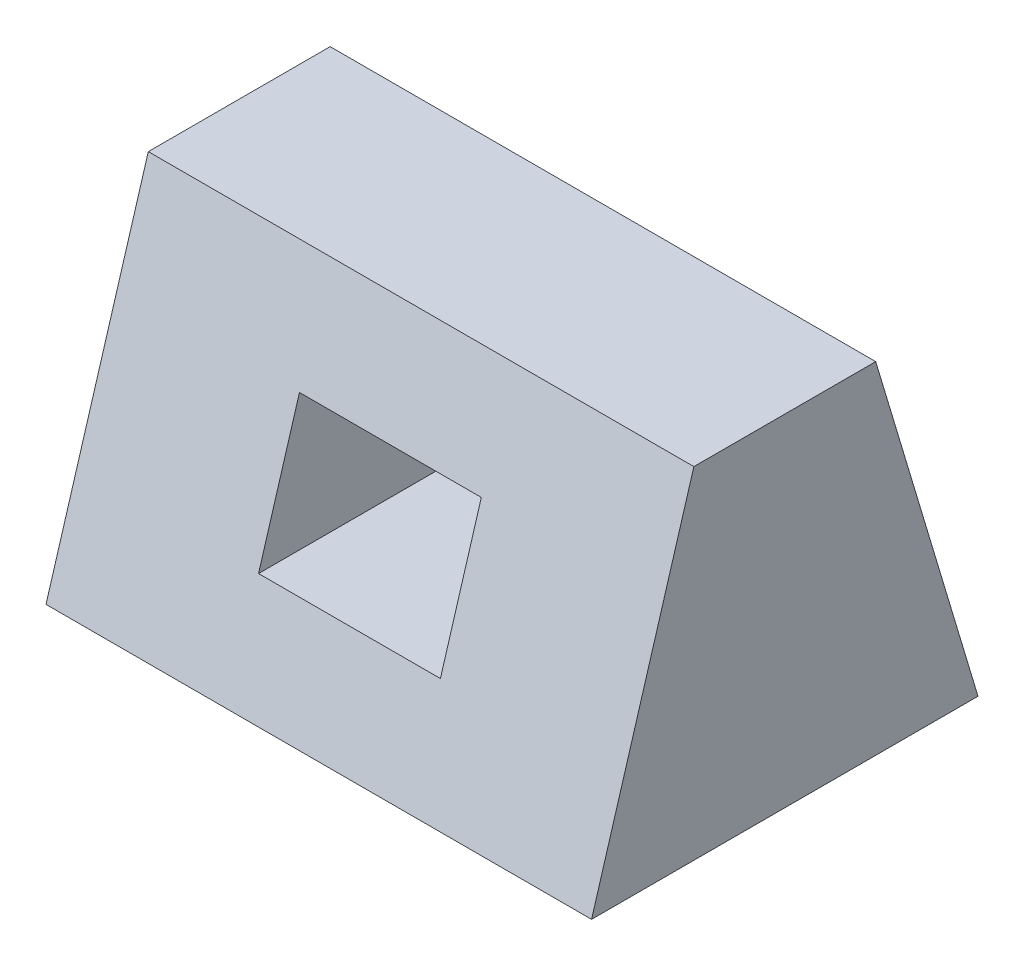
ISO-10303-21;
HEADER;
FILE_DESCRIPTION(('STEP AP214'),'2;1');
FILE_NAME('part.step','',(''),(''),'','','');
FILE_SCHEMA(('AUTOMOTIVE_DESIGN { 1 0 10303 214 1 1 1 1 }'));
ENDSEC;
DATA;
#1=APPLICATION_CONTEXT('core data for automotive mechanical design processes');
#2=APPLICATION_PROTOCOL_DEFINITION('international standard','automotive_design',2000,#1);
#3=PRODUCT_CONTEXT('',#1,'mechanical');
#4=PRODUCT('Part','Part','',(#3));
#5=PRODUCT_RELATED_PRODUCT_CATEGORY('part','',(#4));
#6=PRODUCT_DEFINITION_FORMATION('','',#4);
#7=PRODUCT_DEFINITION_CONTEXT('part definition',#1,'design');
#8=PRODUCT_DEFINITION('design','',#6,#7);
#9=PRODUCT_DEFINITION_SHAPE('','',#8);
#10=(LENGTH_UNIT() NAMED_UNIT(*) SI_UNIT(.MILLI.,.METRE.));
#11=(NAMED_UNIT(*) PLANE_ANGLE_UNIT() SI_UNIT($,.RADIAN.));
#12=(NAMED_UNIT(*) SI_UNIT($,.STERADIAN.) SOLID_ANGLE_UNIT());
#13=UNCERTAINTY_MEASURE_WITH_UNIT(LENGTH_MEASURE(1.E-05),#10,'distance_accuracy_value','');
#14=(GEOMETRIC_REPRESENTATION_CONTEXT(3) GLOBAL_UNCERTAINTY_ASSIGNED_CONTEXT((#13)) GLOBAL_UNIT_ASSIGNED_CONTEXT((#10,
#11,#12)) REPRESENTATION_CONTEXT('',''));
#15=CARTESIAN_POINT('',(0.,0.,0.));
#16=DIRECTION('',(0.,0.,1.));
#17=DIRECTION('',(1.,0.,0.));
#18=AXIS2_PLACEMENT_3D('',#15,#16,#17);
#19=CARTESIAN_POINT('',(120.,75.,20.));
#20=DIRECTION('',(0.,-0.287347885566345,-0.957826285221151));
#21=DIRECTION('',(0.,0.957826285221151,-0.287347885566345));
#22=AXIS2_PLACEMENT_3D('',#19,#20,#21);
#23=PLANE('',#22);
#24=DIRECTION('',(-1.,0.,0.));
#25=VECTOR('',#24,1.);
#26=CARTESIAN_POINT('',(120.,22.5,35.75));
#27=LINE('',#26,#25);
#28=CARTESIAN_POINT('',(80.,22.5,35.75));
#29=VERTEX_POINT('',#28);
#30=CARTESIAN_POINT('',(40.,22.5,35.75));
#31=VERTEX_POINT('',#30);
#32=EDGE_CURVE('E151',#29,#31,#27,.T.);
#33=ORIENTED_EDGE('',*,*,#32,.T.);
#34=DIRECTION('',(0.,0.957826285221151,-0.287347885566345));
#35=VECTOR('',#34,1.);
#36=CARTESIAN_POINT('',(40.,75.,20.));
#37=LINE('',#36,#35);
#38=CARTESIAN_POINT('',(40.,52.5,26.75));
#39=VERTEX_POINT('',#38);
#40=EDGE_CURVE('E104',#31,#39,#37,.T.);
#41=ORIENTED_EDGE('',*,*,#40,.T.);
#42=DIRECTION('',(1.,0.,0.));
#43=VECTOR('',#42,1.);
#44=CARTESIAN_POINT('',(120.,52.5,26.75));
#45=LINE('',#44,#43);
#46=CARTESIAN_POINT('',(80.,52.5,26.75));
#47=VERTEX_POINT('',#46);
#48=EDGE_CURVE('E145',#39,#47,#45,.T.);
#49=ORIENTED_EDGE('',*,*,#48,.T.);
#50=DIRECTION('',(0.,-0.957826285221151,0.287347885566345));
#51=VECTOR('',#50,1.);
#52=CARTESIAN_POINT('',(80.,75.,20.));
#53=LINE('',#52,#51);
#54=EDGE_CURVE('E148',#47,#29,#53,.T.);
#55=ORIENTED_EDGE('',*,*,#54,.T.);
#56=EDGE_LOOP('',(#33,#41,#49,#55));
#57=FACE_BOUND('',#56,.T.);
#58=DIRECTION('',(0.,-0.957826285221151,0.287347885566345));
#59=VECTOR('',#58,1.);
#60=CARTESIAN_POINT('',(0.,75.,20.));
#61=LINE('',#60,#59);
#62=CARTESIAN_POINT('',(0.,75.,20.));
#63=VERTEX_POINT('',#62);
#64=CARTESIAN_POINT('',(0.,0.,42.5));
#65=VERTEX_POINT('',#64);
#66=EDGE_CURVE('E134',#63,#65,#61,.T.);
#67=ORIENTED_EDGE('',*,*,#66,.T.);
#68=DIRECTION('',(-1.,0.,0.));
#69=VECTOR('',#68,1.);
#70=CARTESIAN_POINT('',(120.,0.,42.5));
#71=LINE('',#70,#69);
#72=CARTESIAN_POINT('',(120.,0.,42.5));
#73=VERTEX_POINT('',#72);
#74=EDGE_CURVE('E97',#73,#65,#71,.T.);
#75=ORIENTED_EDGE('',*,*,#74,.F.);
#76=DIRECTION('',(0.,-0.957826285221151,0.287347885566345));
#77=VECTOR('',#76,1.);
#78=CARTESIAN_POINT('',(120.,75.,20.));
#79=LINE('',#78,#77);
#80=CARTESIAN_POINT('',(120.,75.,20.));
#81=VERTEX_POINT('',#80);
#82=EDGE_CURVE('E129',#81,#73,#79,.T.);
#83=ORIENTED_EDGE('',*,*,#82,.F.);
#84=DIRECTION('',(-1.,0.,0.));
#85=VECTOR('',#84,1.);
#86=CARTESIAN_POINT('',(120.,75.,20.));
#87=LINE('',#86,#85);
#88=EDGE_CURVE('E123',#81,#63,#87,.T.);
#89=ORIENTED_EDGE('',*,*,#88,.T.);
#90=EDGE_LOOP('',(#67,#75,#83,#89));
#91=FACE_BOUND('',#90,.T.);
#92=ADVANCED_FACE('F31',(#57,#91),#23,.F.);
#93=CARTESIAN_POINT('',(120.,0.,42.5));
#94=DIRECTION('',(0.,1.,0.));
#95=DIRECTION('',(0.,0.,1.));
#96=AXIS2_PLACEMENT_3D('',#93,#94,#95);
#97=PLANE('',#96);
#98=DIRECTION('',(0.,0.,-1.));
#99=VECTOR('',#98,1.);
#100=CARTESIAN_POINT('',(0.,0.,42.5));
#101=LINE('',#100,#99);
#102=CARTESIAN_POINT('',(0.,0.,-42.5));
#103=VERTEX_POINT('',#102);
#104=EDGE_CURVE('E132',#65,#103,#101,.T.);
#105=ORIENTED_EDGE('',*,*,#104,.T.);
#106=DIRECTION('',(-1.,0.,0.));
#107=VECTOR('',#106,1.);
#108=CARTESIAN_POINT('',(120.,0.,-42.5));
#109=LINE('',#108,#107);
#110=CARTESIAN_POINT('',(120.,0.,-42.5));
#111=VERTEX_POINT('',#110);
#112=EDGE_CURVE('E117',#111,#103,#109,.T.);
#113=ORIENTED_EDGE('',*,*,#112,.F.);
#114=DIRECTION('',(0.,0.,-1.));
#115=VECTOR('',#114,1.);
#116=CARTESIAN_POINT('',(120.,0.,42.5));
#117=LINE('',#116,#115);
#118=EDGE_CURVE('E140',#73,#111,#117,.T.);
#119=ORIENTED_EDGE('',*,*,#118,.F.);
#120=ORIENTED_EDGE('',*,*,#74,.T.);
#121=EDGE_LOOP('',(#105,#113,#119,#120));
#122=FACE_BOUND('',#121,.T.);
#123=ADVANCED_FACE('F172',(#122),#97,.F.);
#124=CARTESIAN_POINT('',(120.,0.,-42.5));
#125=DIRECTION('',(0.,-0.287347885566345,0.957826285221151));
#126=DIRECTION('',(0.,-0.957826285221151,-0.287347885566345));
#127=AXIS2_PLACEMENT_3D('',#124,#125,#126);
#128=PLANE('',#127);
#129=DIRECTION('',(-1.,0.,0.));
#130=VECTOR('',#129,1.);
#131=CARTESIAN_POINT('',(120.,52.5,-26.75));
#132=LINE('',#131,#130);
#133=CARTESIAN_POINT('',(80.,52.5,-26.75));
#134=VERTEX_POINT('',#133);
#135=CARTESIAN_POINT('',(40.,52.5,-26.75));
#136=VERTEX_POINT('',#135);
#137=EDGE_CURVE('E38',#134,#136,#132,.T.);
#138=ORIENTED_EDGE('',*,*,#137,.T.);
#139=DIRECTION('',(0.,-0.957826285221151,-0.287347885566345));
#140=VECTOR('',#139,1.);
#141=CARTESIAN_POINT('',(40.,0.,-42.5));
#142=LINE('',#141,#140);
#143=CARTESIAN_POINT('',(40.,22.5,-35.75));
#144=VERTEX_POINT('',#143);
#145=EDGE_CURVE('E11',#136,#144,#142,.T.);
#146=ORIENTED_EDGE('',*,*,#145,.T.);
#147=DIRECTION('',(1.,0.,0.));
#148=VECTOR('',#147,1.);
#149=CARTESIAN_POINT('',(120.,22.5,-35.75));
#150=LINE('',#149,#148);
#151=CARTESIAN_POINT('',(80.,22.5,-35.75));
#152=VERTEX_POINT('',#151);
#153=EDGE_CURVE('E92',#144,#152,#150,.T.);
#154=ORIENTED_EDGE('',*,*,#153,.T.);
#155=DIRECTION('',(0.,0.957826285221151,0.287347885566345));
#156=VECTOR('',#155,1.);
#157=CARTESIAN_POINT('',(80.,0.,-42.5));
#158=LINE('',#157,#156);
#159=EDGE_CURVE('E96',#152,#134,#158,.T.);
#160=ORIENTED_EDGE('',*,*,#159,.T.);
#161=EDGE_LOOP('',(#138,#146,#154,#160));
#162=FACE_BOUND('',#161,.T.);
#163=DIRECTION('',(0.,0.957826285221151,0.287347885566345));
#164=VECTOR('',#163,1.);
#165=CARTESIAN_POINT('',(0.,0.,-42.5));
#166=LINE('',#165,#164);
#167=CARTESIAN_POINT('',(0.,75.,-20.));
#168=VERTEX_POINT('',#167);
#169=EDGE_CURVE('E130',#103,#168,#166,.T.);
#170=ORIENTED_EDGE('',*,*,#169,.T.);
#171=DIRECTION('',(-1.,0.,0.));
#172=VECTOR('',#171,1.);
#173=CARTESIAN_POINT('',(120.,75.,-20.));
#174=LINE('',#173,#172);
#175=CARTESIAN_POINT('',(120.,75.,-20.));
#176=VERTEX_POINT('',#175);
#177=EDGE_CURVE('E120',#176,#168,#174,.T.);
#178=ORIENTED_EDGE('',*,*,#177,.F.);
#179=DIRECTION('',(0.,0.957826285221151,0.287347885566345));
#180=VECTOR('',#179,1.);
#181=CARTESIAN_POINT('',(120.,0.,-42.5));
#182=LINE('',#181,#180);
#183=EDGE_CURVE('E138',#111,#176,#182,.T.);
#184=ORIENTED_EDGE('',*,*,#183,.F.);
#185=ORIENTED_EDGE('',*,*,#112,.T.);
#186=EDGE_LOOP('',(#170,#178,#184,#185));
#187=FACE_BOUND('',#186,.T.);
#188=ADVANCED_FACE('F108',(#162,#187),#128,.F.);
#189=CARTESIAN_POINT('',(120.,75.,-20.));
#190=DIRECTION('',(0.,-1.,0.));
#191=DIRECTION('',(0.,0.,-1.));
#192=AXIS2_PLACEMENT_3D('',#189,#190,#191);
#193=PLANE('',#192);
#194=DIRECTION('',(0.,0.,1.));
#195=VECTOR('',#194,1.);
#196=CARTESIAN_POINT('',(0.,75.,-20.));
#197=LINE('',#196,#195);
#198=EDGE_CURVE('E127',#168,#63,#197,.T.);
#199=ORIENTED_EDGE('',*,*,#198,.T.);
#200=ORIENTED_EDGE('',*,*,#88,.F.);
#201=DIRECTION('',(0.,0.,1.));
#202=VECTOR('',#201,1.);
#203=CARTESIAN_POINT('',(120.,75.,-20.));
#204=LINE('',#203,#202);
#205=EDGE_CURVE('E126',#176,#81,#204,.T.);
#206=ORIENTED_EDGE('',*,*,#205,.F.);
#207=ORIENTED_EDGE('',*,*,#177,.T.);
#208=EDGE_LOOP('',(#199,#200,#206,#207));
#209=FACE_BOUND('',#208,.T.);
#210=ADVANCED_FACE('F180',(#209),#193,.F.);
#211=CARTESIAN_POINT('',(120.,0.,42.5));
#212=DIRECTION('',(1.,0.,0.));
#213=DIRECTION('',(0.,0.,-1.));
#214=AXIS2_PLACEMENT_3D('',#211,#212,#213);
#215=PLANE('',#214);
#216=ORIENTED_EDGE('',*,*,#82,.T.);
#217=ORIENTED_EDGE('',*,*,#118,.T.);
#218=ORIENTED_EDGE('',*,*,#183,.T.);
#219=ORIENTED_EDGE('',*,*,#205,.T.);
#220=EDGE_LOOP('',(#216,#217,#218,#219));
#221=FACE_BOUND('',#220,.T.);
#222=ADVANCED_FACE('F185',(#221),#215,.T.);
#223=CARTESIAN_POINT('',(0.,0.,42.5));
#224=DIRECTION('',(1.,0.,0.));
#225=DIRECTION('',(0.,0.,-1.));
#226=AXIS2_PLACEMENT_3D('',#223,#224,#225);
#227=PLANE('',#226);
#228=ORIENTED_EDGE('',*,*,#66,.F.);
#229=ORIENTED_EDGE('',*,*,#198,.F.);
#230=ORIENTED_EDGE('',*,*,#169,.F.);
#231=ORIENTED_EDGE('',*,*,#104,.F.);
#232=EDGE_LOOP('',(#228,#229,#230,#231));
#233=FACE_BOUND('',#232,.T.);
#234=ADVANCED_FACE('F169',(#233),#227,.F.);
#235=CARTESIAN_POINT('',(40.,52.5,-40.));
#236=DIRECTION('',(-1.,0.,0.));
#237=DIRECTION('',(0.,0.,1.));
#238=AXIS2_PLACEMENT_3D('',#235,#236,#237);
#239=PLANE('',#238);
#240=DIRECTION('',(0.,0.,1.));
#241=VECTOR('',#240,1.);
#242=CARTESIAN_POINT('',(40.,22.5,-40.));
#243=LINE('',#242,#241);
#244=EDGE_CURVE('E45',#144,#31,#243,.T.);
#245=ORIENTED_EDGE('',*,*,#244,.F.);
#246=ORIENTED_EDGE('',*,*,#145,.F.);
#247=DIRECTION('',(0.,0.,1.));
#248=VECTOR('',#247,1.);
#249=CARTESIAN_POINT('',(40.,52.5,-40.));
#250=LINE('',#249,#248);
#251=EDGE_CURVE('E152',#136,#39,#250,.T.);
#252=ORIENTED_EDGE('',*,*,#251,.T.);
#253=ORIENTED_EDGE('',*,*,#40,.F.);
#254=EDGE_LOOP('',(#245,#246,#252,#253));
#255=FACE_BOUND('',#254,.T.);
#256=ADVANCED_FACE('F100',(#255),#239,.F.);
#257=CARTESIAN_POINT('',(40.,52.5,-40.));
#258=DIRECTION('',(0.,1.,0.));
#259=DIRECTION('',(0.,0.,1.));
#260=AXIS2_PLACEMENT_3D('',#257,#258,#259);
#261=PLANE('',#260);
#262=ORIENTED_EDGE('',*,*,#251,.F.);
#263=ORIENTED_EDGE('',*,*,#137,.F.);
#264=DIRECTION('',(0.,0.,1.));
#265=VECTOR('',#264,1.);
#266=CARTESIAN_POINT('',(80.,52.5,-40.));
#267=LINE('',#266,#265);
#268=EDGE_CURVE('E155',#134,#47,#267,.T.);
#269=ORIENTED_EDGE('',*,*,#268,.T.);
#270=ORIENTED_EDGE('',*,*,#48,.F.);
#271=EDGE_LOOP('',(#262,#263,#269,#270));
#272=FACE_BOUND('',#271,.T.);
#273=ADVANCED_FACE('F161',(#272),#261,.F.);
#274=CARTESIAN_POINT('',(80.,52.5,-40.));
#275=DIRECTION('',(1.,0.,0.));
#276=DIRECTION('',(0.,0.,-1.));
#277=AXIS2_PLACEMENT_3D('',#274,#275,#276);
#278=PLANE('',#277);
#279=ORIENTED_EDGE('',*,*,#268,.F.);
#280=ORIENTED_EDGE('',*,*,#159,.F.);
#281=DIRECTION('',(0.,0.,1.));
#282=VECTOR('',#281,1.);
#283=CARTESIAN_POINT('',(80.,22.5,-40.));
#284=LINE('',#283,#282);
#285=EDGE_CURVE('E50',#152,#29,#284,.T.);
#286=ORIENTED_EDGE('',*,*,#285,.T.);
#287=ORIENTED_EDGE('',*,*,#54,.F.);
#288=EDGE_LOOP('',(#279,#280,#286,#287));
#289=FACE_BOUND('',#288,.T.);
#290=ADVANCED_FACE('F160',(#289),#278,.F.);
#291=CARTESIAN_POINT('',(40.,22.5,-40.));
#292=DIRECTION('',(0.,-1.,0.));
#293=DIRECTION('',(0.,0.,-1.));
#294=AXIS2_PLACEMENT_3D('',#291,#292,#293);
#295=PLANE('',#294);
#296=ORIENTED_EDGE('',*,*,#285,.F.);
#297=ORIENTED_EDGE('',*,*,#153,.F.);
#298=ORIENTED_EDGE('',*,*,#244,.T.);
#299=ORIENTED_EDGE('',*,*,#32,.F.);
#300=EDGE_LOOP('',(#296,#297,#298,#299));
#301=FACE_BOUND('',#300,.T.);
#302=ADVANCED_FACE('F93',(#301),#295,.F.);
#303=CLOSED_SHELL('',(#92,#123,#188,#210,#222,#234,#256,#273,#290,#302));
#304=MANIFOLD_SOLID_BREP('B2',#303);
#305=ADVANCED_BREP_SHAPE_REPRESENTATION('',(#18,#304),#14);
#306=SHAPE_DEFINITION_REPRESENTATION(#9,#305);
ENDSEC;
END-ISO-10303-21;
